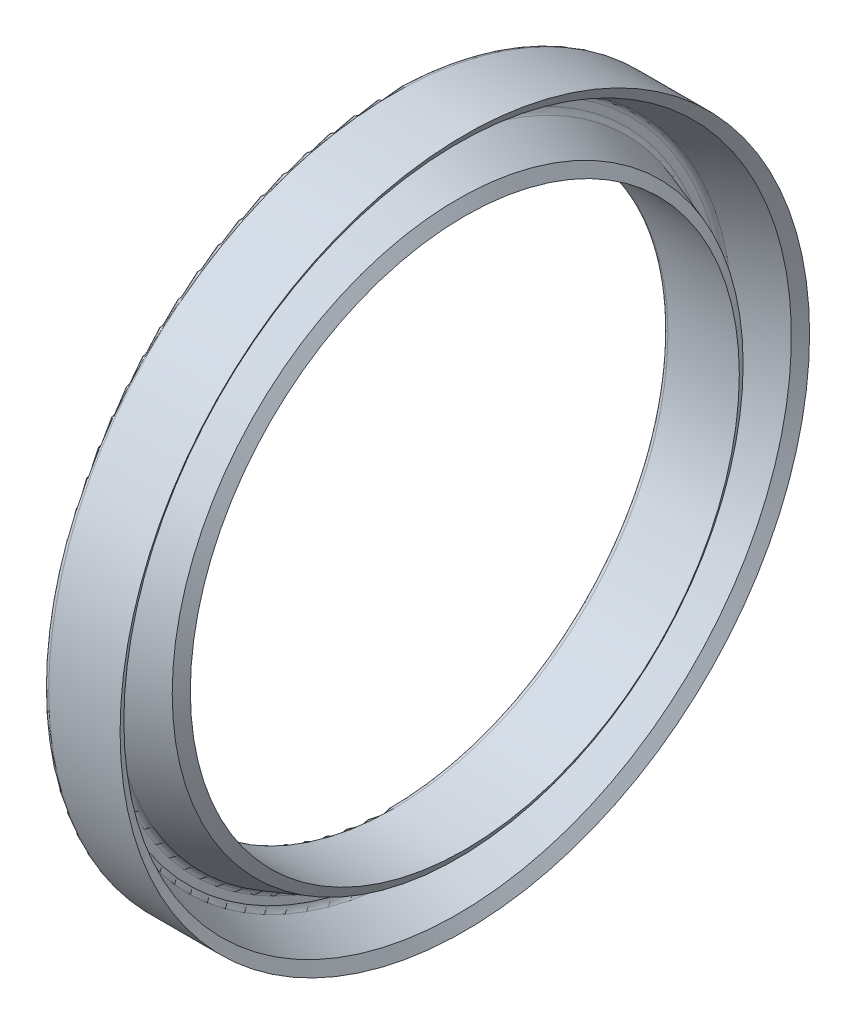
ISO-10303-21;
HEADER;
FILE_DESCRIPTION(('STEP AP214'),'2;1');
FILE_NAME('part.step','',(''),(''),'','','');
FILE_SCHEMA(('AUTOMOTIVE_DESIGN { 1 0 10303 214 1 1 1 1 }'));
ENDSEC;
DATA;
#1=APPLICATION_CONTEXT('core data for automotive mechanical design processes');
#2=APPLICATION_PROTOCOL_DEFINITION('international standard','automotive_design',2000,#1);
#3=PRODUCT_CONTEXT('',#1,'mechanical');
#4=PRODUCT('Part','Part','',(#3));
#5=PRODUCT_RELATED_PRODUCT_CATEGORY('part','',(#4));
#6=PRODUCT_DEFINITION_FORMATION('','',#4);
#7=PRODUCT_DEFINITION_CONTEXT('part definition',#1,'design');
#8=PRODUCT_DEFINITION('design','',#6,#7);
#9=PRODUCT_DEFINITION_SHAPE('','',#8);
#10=(LENGTH_UNIT() NAMED_UNIT(*) SI_UNIT(.MILLI.,.METRE.));
#11=(NAMED_UNIT(*) PLANE_ANGLE_UNIT() SI_UNIT($,.RADIAN.));
#12=(NAMED_UNIT(*) SI_UNIT($,.STERADIAN.) SOLID_ANGLE_UNIT());
#13=UNCERTAINTY_MEASURE_WITH_UNIT(LENGTH_MEASURE(1.E-05),#10,'distance_accuracy_value','');
#14=(GEOMETRIC_REPRESENTATION_CONTEXT(3) GLOBAL_UNCERTAINTY_ASSIGNED_CONTEXT((#13)) GLOBAL_UNIT_ASSIGNED_CONTEXT((#10,
#11,#12)) REPRESENTATION_CONTEXT('',''));
#15=CARTESIAN_POINT('',(0.,0.,0.));
#16=DIRECTION('',(0.,0.,1.));
#17=DIRECTION('',(1.,0.,0.));
#18=AXIS2_PLACEMENT_3D('',#15,#16,#17);
#19=CARTESIAN_POINT('',(6.34637343,0.,0.));
#20=DIRECTION('',(1.,0.,0.));
#21=DIRECTION('',(0.,0.,-1.));
#22=AXIS2_PLACEMENT_3D('',#19,#20,#21);
#23=CONICAL_SURFACE('',#22,30.4,0.991875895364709);
#24=CARTESIAN_POINT('',(7.00000000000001,0.,0.));
#25=DIRECTION('',(-1.,0.,0.));
#26=DIRECTION('',(0.,0.,1.));
#27=AXIS2_PLACEMENT_3D('',#24,#25,#26);
#28=CIRCLE('',#27,31.4);
#29=CARTESIAN_POINT('',(7.00000000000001,0.,31.4));
#30=VERTEX_POINT('',#29);
#31=EDGE_CURVE('E68',#30,#30,#28,.T.);
#32=ORIENTED_EDGE('',*,*,#31,.F.);
#33=EDGE_LOOP('',(#32));
#34=FACE_BOUND('',#33,.T.);
#35=CARTESIAN_POINT('',(6.34637343,0.,0.));
#36=DIRECTION('',(-1.,0.,0.));
#37=DIRECTION('',(0.,0.,1.));
#38=AXIS2_PLACEMENT_3D('',#35,#36,#37);
#39=CIRCLE('',#38,30.4);
#40=CARTESIAN_POINT('',(6.34637343,0.,30.4));
#41=VERTEX_POINT('',#40);
#42=EDGE_CURVE('E10',#41,#41,#39,.T.);
#43=ORIENTED_EDGE('',*,*,#42,.T.);
#44=EDGE_LOOP('',(#43));
#45=FACE_BOUND('',#44,.T.);
#46=ADVANCED_FACE('F28',(#34,#45),#23,.F.);
#47=CARTESIAN_POINT('',(2.33688312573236,0.,0.));
#48=DIRECTION('',(1.,0.,0.));
#49=DIRECTION('',(0.,0.,-1.));
#50=AXIS2_PLACEMENT_3D('',#47,#48,#49);
#51=CONICAL_SURFACE('',#50,29.0162635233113,0.332316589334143);
#52=ORIENTED_EDGE('',*,*,#42,.F.);
#53=EDGE_LOOP('',(#52));
#54=FACE_BOUND('',#53,.T.);
#55=CARTESIAN_POINT('',(2.33688312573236,0.,0.));
#56=DIRECTION('',(-1.,0.,0.));
#57=DIRECTION('',(0.,0.,1.));
#58=AXIS2_PLACEMENT_3D('',#55,#56,#57);
#59=CIRCLE('',#58,29.0162635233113);
#60=CARTESIAN_POINT('',(2.33688312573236,0.,29.0162635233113));
#61=VERTEX_POINT('',#60);
#62=EDGE_CURVE('E34',#61,#61,#59,.T.);
#63=ORIENTED_EDGE('',*,*,#62,.T.);
#64=EDGE_LOOP('',(#63));
#65=FACE_BOUND('',#64,.T.);
#66=ADVANCED_FACE('F75',(#54,#65),#51,.F.);
#67=CARTESIAN_POINT('',(2.5,0.,0.));
#68=DIRECTION('',(-1.,0.,0.));
#69=DIRECTION('',(0.,0.,1.));
#70=AXIS2_PLACEMENT_3D('',#67,#68,#69);
#71=TOROIDAL_SURFACE('',#70,28.543618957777,0.499999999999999);
#72=ORIENTED_EDGE('',*,*,#62,.F.);
#73=EDGE_LOOP('',(#72));
#74=FACE_BOUND('',#73,.T.);
#75=CARTESIAN_POINT('',(2.,0.,0.));
#76=DIRECTION('',(-1.,0.,0.));
#77=DIRECTION('',(0.,0.,1.));
#78=AXIS2_PLACEMENT_3D('',#75,#76,#77);
#79=CIRCLE('',#78,28.543618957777);
#80=CARTESIAN_POINT('',(2.,0.,28.543618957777));
#81=VERTEX_POINT('',#80);
#82=EDGE_CURVE('E38',#81,#81,#79,.T.);
#83=ORIENTED_EDGE('',*,*,#82,.T.);
#84=EDGE_LOOP('',(#83));
#85=FACE_BOUND('',#84,.T.);
#86=ADVANCED_FACE('F79',(#74,#85),#71,.F.);
#87=CARTESIAN_POINT('',(2.,27.8564779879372,0.));
#88=DIRECTION('',(-1.,0.,0.));
#89=DIRECTION('',(0.,0.,1.));
#90=AXIS2_PLACEMENT_3D('',#87,#88,#89);
#91=PLANE('',#90);
#92=ORIENTED_EDGE('',*,*,#82,.F.);
#93=EDGE_LOOP('',(#92));
#94=FACE_BOUND('',#93,.T.);
#95=CARTESIAN_POINT('',(2.,0.,0.));
#96=DIRECTION('',(-1.,0.,0.));
#97=DIRECTION('',(0.,0.,1.));
#98=AXIS2_PLACEMENT_3D('',#95,#96,#97);
#99=CIRCLE('',#98,27.8564779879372);
#100=CARTESIAN_POINT('',(2.,0.,27.8564779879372));
#101=VERTEX_POINT('',#100);
#102=EDGE_CURVE('E42',#101,#101,#99,.T.);
#103=ORIENTED_EDGE('',*,*,#102,.T.);
#104=EDGE_LOOP('',(#103));
#105=FACE_BOUND('',#104,.T.);
#106=ADVANCED_FACE('F84',(#94,#105),#91,.F.);
#107=CARTESIAN_POINT('',(2.5,0.,0.));
#108=DIRECTION('',(-1.,0.,0.));
#109=DIRECTION('',(0.,0.,1.));
#110=AXIS2_PLACEMENT_3D('',#107,#108,#109);
#111=TOROIDAL_SURFACE('',#110,27.8564779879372,0.5);
#112=ORIENTED_EDGE('',*,*,#102,.F.);
#113=EDGE_LOOP('',(#112));
#114=FACE_BOUND('',#113,.T.);
#115=CARTESIAN_POINT('',(2.3370046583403,0.,0.));
#116=DIRECTION('',(-1.,0.,0.));
#117=DIRECTION('',(0.,0.,1.));
#118=AXIS2_PLACEMENT_3D('',#115,#116,#117);
#119=CIRCLE('',#118,27.383791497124);
#120=CARTESIAN_POINT('',(2.3370046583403,0.,27.383791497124));
#121=VERTEX_POINT('',#120);
#122=EDGE_CURVE('E47',#121,#121,#119,.T.);
#123=ORIENTED_EDGE('',*,*,#122,.T.);
#124=EDGE_LOOP('',(#123));
#125=FACE_BOUND('',#124,.T.);
#126=ADVANCED_FACE('F90',(#114,#125),#111,.F.);
#127=CARTESIAN_POINT('',(6.35,0.,0.));
#128=DIRECTION('',(-1.,0.,0.));
#129=DIRECTION('',(0.,0.,1.));
#130=AXIS2_PLACEMENT_3D('',#127,#128,#129);
#131=CONICAL_SURFACE('',#130,26.,0.332059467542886);
#132=ORIENTED_EDGE('',*,*,#122,.F.);
#133=EDGE_LOOP('',(#132));
#134=FACE_BOUND('',#133,.T.);
#135=CARTESIAN_POINT('',(6.35,0.,0.));
#136=DIRECTION('',(-1.,0.,0.));
#137=DIRECTION('',(0.,0.,1.));
#138=AXIS2_PLACEMENT_3D('',#135,#136,#137);
#139=CIRCLE('',#138,26.);
#140=CARTESIAN_POINT('',(6.35,0.,26.));
#141=VERTEX_POINT('',#140);
#142=EDGE_CURVE('E50',#141,#141,#139,.T.);
#143=ORIENTED_EDGE('',*,*,#142,.T.);
#144=EDGE_LOOP('',(#143));
#145=FACE_BOUND('',#144,.T.);
#146=ADVANCED_FACE('F94',(#134,#145),#131,.T.);
#147=CARTESIAN_POINT('',(7.,0.,0.));
#148=DIRECTION('',(-1.,0.,0.));
#149=DIRECTION('',(0.,0.,1.));
#150=AXIS2_PLACEMENT_3D('',#147,#148,#149);
#151=CONICAL_SURFACE('',#150,25.,0.994421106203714);
#152=ORIENTED_EDGE('',*,*,#142,.F.);
#153=EDGE_LOOP('',(#152));
#154=FACE_BOUND('',#153,.T.);
#155=CARTESIAN_POINT('',(7.,0.,0.));
#156=DIRECTION('',(-1.,0.,0.));
#157=DIRECTION('',(0.,0.,1.));
#158=AXIS2_PLACEMENT_3D('',#155,#156,#157);
#159=CIRCLE('',#158,25.);
#160=CARTESIAN_POINT('',(7.,0.,25.));
#161=VERTEX_POINT('',#160);
#162=EDGE_CURVE('E53',#161,#161,#159,.T.);
#163=ORIENTED_EDGE('',*,*,#162,.T.);
#164=EDGE_LOOP('',(#163));
#165=FACE_BOUND('',#164,.T.);
#166=ADVANCED_FACE('F98',(#154,#165),#151,.T.);
#167=CARTESIAN_POINT('',(0.,0.,0.));
#168=DIRECTION('',(-1.,0.,0.));
#169=DIRECTION('',(0.,0.,1.));
#170=AXIS2_PLACEMENT_3D('',#167,#168,#169);
#171=CYLINDRICAL_SURFACE('',#170,25.);
#172=ORIENTED_EDGE('',*,*,#162,.F.);
#173=EDGE_LOOP('',(#172));
#174=FACE_BOUND('',#173,.T.);
#175=CARTESIAN_POINT('',(0.50000000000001,0.,0.));
#176=DIRECTION('',(-1.,0.,0.));
#177=DIRECTION('',(0.,0.,1.));
#178=AXIS2_PLACEMENT_3D('',#175,#176,#177);
#179=CIRCLE('',#178,25.);
#180=CARTESIAN_POINT('',(0.50000000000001,0.,25.));
#181=VERTEX_POINT('',#180);
#182=EDGE_CURVE('E56',#181,#181,#179,.T.);
#183=ORIENTED_EDGE('',*,*,#182,.T.);
#184=EDGE_LOOP('',(#183));
#185=FACE_BOUND('',#184,.T.);
#186=ADVANCED_FACE('F102',(#174,#185),#171,.F.);
#187=CARTESIAN_POINT('',(0.500000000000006,0.,0.));
#188=DIRECTION('',(-1.,0.,0.));
#189=DIRECTION('',(0.,0.,1.));
#190=AXIS2_PLACEMENT_3D('',#187,#188,#189);
#191=TOROIDAL_SURFACE('',#190,25.5,0.5);
#192=ORIENTED_EDGE('',*,*,#182,.F.);
#193=EDGE_LOOP('',(#192));
#194=FACE_BOUND('',#193,.T.);
#195=CARTESIAN_POINT('',(0.,0.,0.));
#196=DIRECTION('',(-1.,0.,0.));
#197=DIRECTION('',(0.,0.,1.));
#198=AXIS2_PLACEMENT_3D('',#195,#196,#197);
#199=CIRCLE('',#198,25.5);
#200=CARTESIAN_POINT('',(0.,0.,25.5));
#201=VERTEX_POINT('',#200);
#202=EDGE_CURVE('E59',#201,#201,#199,.T.);
#203=ORIENTED_EDGE('',*,*,#202,.T.);
#204=EDGE_LOOP('',(#203));
#205=FACE_BOUND('',#204,.T.);
#206=ADVANCED_FACE('F106',(#194,#205),#191,.T.);
#207=CARTESIAN_POINT('',(0.,30.9,0.));
#208=DIRECTION('',(1.,0.,0.));
#209=DIRECTION('',(0.,0.,-1.));
#210=AXIS2_PLACEMENT_3D('',#207,#208,#209);
#211=PLANE('',#210);
#212=ORIENTED_EDGE('',*,*,#202,.F.);
#213=EDGE_LOOP('',(#212));
#214=FACE_BOUND('',#213,.T.);
#215=CARTESIAN_POINT('',(0.,0.,0.));
#216=DIRECTION('',(-1.,0.,0.));
#217=DIRECTION('',(0.,0.,1.));
#218=AXIS2_PLACEMENT_3D('',#215,#216,#217);
#219=CIRCLE('',#218,30.9);
#220=CARTESIAN_POINT('',(0.,0.,30.9));
#221=VERTEX_POINT('',#220);
#222=EDGE_CURVE('E62',#221,#221,#219,.T.);
#223=ORIENTED_EDGE('',*,*,#222,.T.);
#224=EDGE_LOOP('',(#223));
#225=FACE_BOUND('',#224,.T.);
#226=ADVANCED_FACE('F110',(#214,#225),#211,.F.);
#227=CARTESIAN_POINT('',(0.500000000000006,0.,0.));
#228=DIRECTION('',(-1.,0.,0.));
#229=DIRECTION('',(0.,0.,1.));
#230=AXIS2_PLACEMENT_3D('',#227,#228,#229);
#231=TOROIDAL_SURFACE('',#230,30.9,0.5);
#232=ORIENTED_EDGE('',*,*,#222,.F.);
#233=EDGE_LOOP('',(#232));
#234=FACE_BOUND('',#233,.T.);
#235=CARTESIAN_POINT('',(0.50000000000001,0.,0.));
#236=DIRECTION('',(-1.,0.,0.));
#237=DIRECTION('',(0.,0.,1.));
#238=AXIS2_PLACEMENT_3D('',#235,#236,#237);
#239=CIRCLE('',#238,31.4);
#240=CARTESIAN_POINT('',(0.50000000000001,0.,31.4));
#241=VERTEX_POINT('',#240);
#242=EDGE_CURVE('E65',#241,#241,#239,.T.);
#243=ORIENTED_EDGE('',*,*,#242,.T.);
#244=EDGE_LOOP('',(#243));
#245=FACE_BOUND('',#244,.T.);
#246=ADVANCED_FACE('F114',(#234,#245),#231,.T.);
#247=CARTESIAN_POINT('',(0.,0.,0.));
#248=DIRECTION('',(-1.,0.,0.));
#249=DIRECTION('',(0.,0.,1.));
#250=AXIS2_PLACEMENT_3D('',#247,#248,#249);
#251=CYLINDRICAL_SURFACE('',#250,31.4);
#252=ORIENTED_EDGE('',*,*,#242,.F.);
#253=EDGE_LOOP('',(#252));
#254=FACE_BOUND('',#253,.T.);
#255=ORIENTED_EDGE('',*,*,#31,.T.);
#256=EDGE_LOOP('',(#255));
#257=FACE_BOUND('',#256,.T.);
#258=ADVANCED_FACE('F72',(#254,#257),#251,.T.);
#259=CLOSED_SHELL('',(#46,#66,#86,#106,#126,#146,#166,#186,#206,#226,#246,#258));
#260=MANIFOLD_SOLID_BREP('B2',#259);
#261=ADVANCED_BREP_SHAPE_REPRESENTATION('',(#18,#260),#14);
#262=SHAPE_DEFINITION_REPRESENTATION(#9,#261);
ENDSEC;
END-ISO-10303-21;
